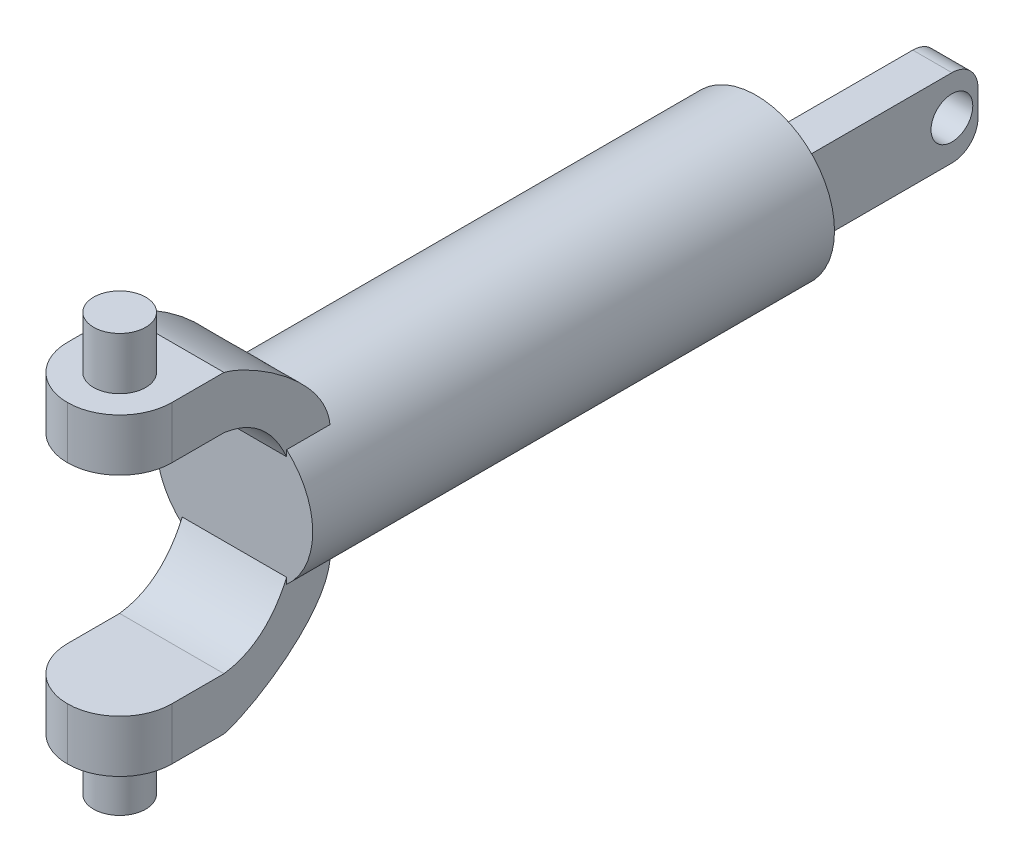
ISO-10303-21;
HEADER;
FILE_DESCRIPTION(('STEP AP214'),'2;1');
FILE_NAME('part.step','',(''),(''),'','','');
FILE_SCHEMA(('AUTOMOTIVE_DESIGN { 1 0 10303 214 1 1 1 1 }'));
ENDSEC;
DATA;
#1=APPLICATION_CONTEXT('core data for automotive mechanical design processes');
#2=APPLICATION_PROTOCOL_DEFINITION('international standard','automotive_design',2000,#1);
#3=PRODUCT_CONTEXT('',#1,'mechanical');
#4=PRODUCT('Part','Part','',(#3));
#5=PRODUCT_RELATED_PRODUCT_CATEGORY('part','',(#4));
#6=PRODUCT_DEFINITION_FORMATION('','',#4);
#7=PRODUCT_DEFINITION_CONTEXT('part definition',#1,'design');
#8=PRODUCT_DEFINITION('design','',#6,#7);
#9=PRODUCT_DEFINITION_SHAPE('','',#8);
#10=(LENGTH_UNIT() NAMED_UNIT(*) SI_UNIT(.MILLI.,.METRE.));
#11=(NAMED_UNIT(*) PLANE_ANGLE_UNIT() SI_UNIT($,.RADIAN.));
#12=(NAMED_UNIT(*) SI_UNIT($,.STERADIAN.) SOLID_ANGLE_UNIT());
#13=UNCERTAINTY_MEASURE_WITH_UNIT(LENGTH_MEASURE(1.E-05),#10,'distance_accuracy_value','');
#14=(GEOMETRIC_REPRESENTATION_CONTEXT(3) GLOBAL_UNCERTAINTY_ASSIGNED_CONTEXT((#13)) GLOBAL_UNIT_ASSIGNED_CONTEXT((#10,
#11,#12)) REPRESENTATION_CONTEXT('',''));
#15=CARTESIAN_POINT('',(0.,0.,0.));
#16=DIRECTION('',(0.,0.,1.));
#17=DIRECTION('',(1.,0.,0.));
#18=AXIS2_PLACEMENT_3D('',#15,#16,#17);
#19=CARTESIAN_POINT('',(0.,0.,-560.));
#20=DIRECTION('',(0.,0.,1.));
#21=DIRECTION('',(1.,0.,0.));
#22=AXIS2_PLACEMENT_3D('',#19,#20,#21);
#23=PLANE('',#22);
#24=CARTESIAN_POINT('',(0.,0.,-560.));
#25=DIRECTION('',(0.,0.,1.));
#26=DIRECTION('',(1.,0.,0.));
#27=AXIS2_PLACEMENT_3D('',#24,#25,#26);
#28=CIRCLE('',#27,75.);
#29=CARTESIAN_POINT('',(75.,0.,-560.));
#30=VERTEX_POINT('',#29);
#31=EDGE_CURVE('E221',#30,#30,#28,.T.);
#32=ORIENTED_EDGE('',*,*,#31,.F.);
#33=EDGE_LOOP('',(#32));
#34=FACE_BOUND('',#33,.T.);
#35=DIRECTION('',(0.,-1.,0.));
#36=VECTOR('',#35,1.);
#37=CARTESIAN_POINT('',(37.5,-37.5,-560.));
#38=LINE('',#37,#36);
#39=CARTESIAN_POINT('',(37.5,37.5,-560.));
#40=VERTEX_POINT('',#39);
#41=CARTESIAN_POINT('',(37.5,-37.5,-560.));
#42=VERTEX_POINT('',#41);
#43=EDGE_CURVE('E188',#40,#42,#38,.T.);
#44=ORIENTED_EDGE('',*,*,#43,.F.);
#45=DIRECTION('',(1.,0.,0.));
#46=VECTOR('',#45,1.);
#47=CARTESIAN_POINT('',(37.5,37.5,-560.));
#48=LINE('',#47,#46);
#49=CARTESIAN_POINT('',(0.,37.5,-560.));
#50=VERTEX_POINT('',#49);
#51=EDGE_CURVE('E199',#50,#40,#48,.T.);
#52=ORIENTED_EDGE('',*,*,#51,.F.);
#53=DIRECTION('',(0.,1.,0.));
#54=VECTOR('',#53,1.);
#55=CARTESIAN_POINT('',(0.,37.5,-560.));
#56=LINE('',#55,#54);
#57=CARTESIAN_POINT('',(0.,-37.5,-560.));
#58=VERTEX_POINT('',#57);
#59=EDGE_CURVE('E208',#58,#50,#56,.T.);
#60=ORIENTED_EDGE('',*,*,#59,.F.);
#61=DIRECTION('',(-1.,0.,0.));
#62=VECTOR('',#61,1.);
#63=CARTESIAN_POINT('',(37.5,-37.5,-560.));
#64=LINE('',#63,#62);
#65=EDGE_CURVE('E202',#42,#58,#64,.T.);
#66=ORIENTED_EDGE('',*,*,#65,.F.);
#67=EDGE_LOOP('',(#44,#52,#60,#66));
#68=FACE_BOUND('',#67,.T.);
#69=ADVANCED_FACE('F38',(#34,#68),#23,.F.);
#70=CARTESIAN_POINT('',(50.,0.,0.));
#71=DIRECTION('',(1.,0.,0.));
#72=DIRECTION('',(0.,0.,-1.));
#73=AXIS2_PLACEMENT_3D('',#70,#71,#72);
#74=PLANE('',#73);
#75=DIRECTION('',(0.,0.,1.));
#76=VECTOR('',#75,1.);
#77=CARTESIAN_POINT('',(50.,55.9016994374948,-560.));
#78=LINE('',#77,#76);
#79=CARTESIAN_POINT('',(50.,55.9016994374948,-101.56051903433));
#80=VERTEX_POINT('',#79);
#81=CARTESIAN_POINT('',(50.,55.9016994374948,-60.));
#82=VERTEX_POINT('',#81);
#83=EDGE_CURVE('E263',#80,#82,#78,.T.);
#84=ORIENTED_EDGE('',*,*,#83,.F.);
#85=CARTESIAN_POINT('',(50.,50.,-101.766630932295));
#86=CARTESIAN_POINT('',(50.,96.3576905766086,-103.379132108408));
#87=CARTESIAN_POINT('',(50.,143.346838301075,-27.0359598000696));
#88=CARTESIAN_POINT('',(50.,150.,0.));
#89=B_SPLINE_CURVE_WITH_KNOTS('',3,(#85,#86,#87,#88),.UNSPECIFIED.,.F.,.F.,(4,4),(0.,1.),.UNSPECIFIED.);
#90=CARTESIAN_POINT('',(50.,150.,0.));
#91=VERTEX_POINT('',#90);
#92=EDGE_CURVE('E277',#80,#91,#89,.T.);
#93=ORIENTED_EDGE('',*,*,#92,.T.);
#94=DIRECTION('',(0.,0.,-1.));
#95=VECTOR('',#94,1.);
#96=CARTESIAN_POINT('',(50.,150.,0.));
#97=LINE('',#96,#95);
#98=CARTESIAN_POINT('',(50.,150.,50.));
#99=VERTEX_POINT('',#98);
#100=EDGE_CURVE('E283',#99,#91,#97,.T.);
#101=ORIENTED_EDGE('',*,*,#100,.F.);
#102=DIRECTION('',(0.,1.,0.));
#103=VECTOR('',#102,1.);
#104=CARTESIAN_POINT('',(50.,0.,50.));
#105=LINE('',#104,#103);
#106=CARTESIAN_POINT('',(50.,100.,50.));
#107=VERTEX_POINT('',#106);
#108=EDGE_CURVE('E371',#99,#107,#105,.F.);
#109=ORIENTED_EDGE('',*,*,#108,.T.);
#110=DIRECTION('',(0.,0.,1.));
#111=VECTOR('',#110,1.);
#112=CARTESIAN_POINT('',(50.,100.,0.));
#113=LINE('',#112,#111);
#114=CARTESIAN_POINT('',(50.,100.,0.));
#115=VERTEX_POINT('',#114);
#116=EDGE_CURVE('E292',#115,#107,#113,.T.);
#117=ORIENTED_EDGE('',*,*,#116,.F.);
#118=CARTESIAN_POINT('',(50.,100.,0.));
#119=CARTESIAN_POINT('',(50.,94.4942840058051,-40.2562345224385));
#120=CARTESIAN_POINT('',(50.,50.,-60.));
#121=B_SPLINE_CURVE_WITH_KNOTS('',2,(#118,#119,#120),.UNSPECIFIED.,.F.,.F.,(3,3),(0.,1.),.UNSPECIFIED.);
#122=CARTESIAN_POINT('',(50.,50.,-60.));
#123=VERTEX_POINT('',#122);
#124=EDGE_CURVE('E295',#115,#123,#121,.T.);
#125=ORIENTED_EDGE('',*,*,#124,.T.);
#126=DIRECTION('',(0.,-1.,0.));
#127=VECTOR('',#126,1.);
#128=CARTESIAN_POINT('',(50.,0.,-60.));
#129=LINE('',#128,#127);
#130=EDGE_CURVE('E229',#82,#123,#129,.T.);
#131=ORIENTED_EDGE('',*,*,#130,.F.);
#132=EDGE_LOOP('',(#84,#93,#101,#109,#117,#125,#131));
#133=FACE_BOUND('',#132,.T.);
#134=ADVANCED_FACE('F324',(#133),#74,.T.);
#135=CARTESIAN_POINT('',(-50.,0.,0.));
#136=DIRECTION('',(1.,0.,0.));
#137=DIRECTION('',(0.,0.,-1.));
#138=AXIS2_PLACEMENT_3D('',#135,#136,#137);
#139=PLANE('',#138);
#140=CARTESIAN_POINT('',(-50.,50.,-101.766630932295));
#141=CARTESIAN_POINT('',(-50.,96.3576905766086,-103.379132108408));
#142=CARTESIAN_POINT('',(-50.,143.346838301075,-27.0359598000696));
#143=CARTESIAN_POINT('',(-50.,150.,0.));
#144=B_SPLINE_CURVE_WITH_KNOTS('',3,(#140,#141,#142,#143),.UNSPECIFIED.,.F.,.F.,(4,4),(0.,1.),.UNSPECIFIED.);
#145=CARTESIAN_POINT('',(-50.,55.9016994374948,-101.56051903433));
#146=VERTEX_POINT('',#145);
#147=CARTESIAN_POINT('',(-50.,150.,0.));
#148=VERTEX_POINT('',#147);
#149=EDGE_CURVE('E347',#146,#148,#144,.T.);
#150=ORIENTED_EDGE('',*,*,#149,.F.);
#151=DIRECTION('',(0.,0.,1.));
#152=VECTOR('',#151,1.);
#153=CARTESIAN_POINT('',(-50.,55.9016994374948,-560.));
#154=LINE('',#153,#152);
#155=CARTESIAN_POINT('',(-50.,55.9016994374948,-60.));
#156=VERTEX_POINT('',#155);
#157=EDGE_CURVE('E338',#146,#156,#154,.T.);
#158=ORIENTED_EDGE('',*,*,#157,.T.);
#159=DIRECTION('',(0.,-1.,0.));
#160=VECTOR('',#159,1.);
#161=CARTESIAN_POINT('',(-50.,0.,-60.));
#162=LINE('',#161,#160);
#163=CARTESIAN_POINT('',(-50.,50.,-60.));
#164=VERTEX_POINT('',#163);
#165=EDGE_CURVE('E394',#156,#164,#162,.T.);
#166=ORIENTED_EDGE('',*,*,#165,.T.);
#167=CARTESIAN_POINT('',(-50.,100.,0.));
#168=CARTESIAN_POINT('',(-50.,94.4942840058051,-40.2562345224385));
#169=CARTESIAN_POINT('',(-50.,50.,-60.));
#170=B_SPLINE_CURVE_WITH_KNOTS('',2,(#167,#168,#169),.UNSPECIFIED.,.F.,.F.,(3,3),(0.,1.),.UNSPECIFIED.);
#171=CARTESIAN_POINT('',(-50.,100.,0.));
#172=VERTEX_POINT('',#171);
#173=EDGE_CURVE('E512',#172,#164,#170,.T.);
#174=ORIENTED_EDGE('',*,*,#173,.F.);
#175=DIRECTION('',(0.,0.,1.));
#176=VECTOR('',#175,1.);
#177=CARTESIAN_POINT('',(-50.,100.,0.));
#178=LINE('',#177,#176);
#179=CARTESIAN_POINT('',(-50.,100.,50.));
#180=VERTEX_POINT('',#179);
#181=EDGE_CURVE('E509',#172,#180,#178,.T.);
#182=ORIENTED_EDGE('',*,*,#181,.T.);
#183=DIRECTION('',(0.,1.,0.));
#184=VECTOR('',#183,1.);
#185=CARTESIAN_POINT('',(-50.,150.,50.));
#186=LINE('',#185,#184);
#187=CARTESIAN_POINT('',(-50.,150.,50.));
#188=VERTEX_POINT('',#187);
#189=EDGE_CURVE('E361',#180,#188,#186,.T.);
#190=ORIENTED_EDGE('',*,*,#189,.T.);
#191=DIRECTION('',(0.,0.,-1.));
#192=VECTOR('',#191,1.);
#193=CARTESIAN_POINT('',(-50.,150.,0.));
#194=LINE('',#193,#192);
#195=EDGE_CURVE('E504',#188,#148,#194,.T.);
#196=ORIENTED_EDGE('',*,*,#195,.T.);
#197=EDGE_LOOP('',(#150,#158,#166,#174,#182,#190,#196));
#198=FACE_BOUND('',#197,.T.);
#199=ADVANCED_FACE('F272',(#198),#139,.F.);
#200=DIRECTION('',(-1.,0.,0.));
#201=VECTOR('',#200,1.);
#202=SURFACE_OF_LINEAR_EXTRUSION('',#89,#201);
#203=ORIENTED_EDGE('',*,*,#92,.F.);
#204=CARTESIAN_POINT('',(50.,55.9016994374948,-101.56051903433));
#205=CARTESIAN_POINT('',(49.3747364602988,56.4609604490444,-101.50287368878));
#206=CARTESIAN_POINT('',(48.7406114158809,57.0092483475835,-101.435819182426));
#207=CARTESIAN_POINT('',(47.4560532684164,58.0828960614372,-101.285729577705));
#208=CARTESIAN_POINT('',(46.8056355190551,58.608276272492,-101.202709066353));
#209=CARTESIAN_POINT('',(45.4890647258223,59.6359130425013,-101.023450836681));
#210=CARTESIAN_POINT('',(44.8229189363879,60.1381799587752,-100.927219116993));
#211=CARTESIAN_POINT('',(43.4754378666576,61.1193978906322,-100.724096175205));
#212=CARTESIAN_POINT('',(42.7941050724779,61.5983526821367,-100.617206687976));
#213=CARTESIAN_POINT('',(41.4168043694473,62.532718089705,-100.39518431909));
#214=CARTESIAN_POINT('',(40.720836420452,62.9881286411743,-100.280051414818));
#215=CARTESIAN_POINT('',(39.3123555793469,63.8767135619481,-100.043401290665));
#216=CARTESIAN_POINT('',(38.59979230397,64.3098023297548,-99.921862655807));
#217=CARTESIAN_POINT('',(37.1610398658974,65.1517607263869,-99.6749364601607));
#218=CARTESIAN_POINT('',(36.4348490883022,65.5606274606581,-99.549548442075));
#219=CARTESIAN_POINT('',(34.9694173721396,66.3538551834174,-99.2969634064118));
#220=CARTESIAN_POINT('',(34.230175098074,66.738213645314,-99.1697662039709));
#221=CARTESIAN_POINT('',(32.7392259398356,67.4821250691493,-98.9154831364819));
#222=CARTESIAN_POINT('',(31.9875181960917,67.841676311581,-98.7883972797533));
#223=CARTESIAN_POINT('',(30.4722520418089,68.535657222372,-98.5361419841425));
#224=CARTESIAN_POINT('',(29.7086931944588,68.8700859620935,-98.4109726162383));
#225=CARTESIAN_POINT('',(27.9788928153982,69.5935751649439,-98.133538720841));
#226=CARTESIAN_POINT('',(27.0095013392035,69.9755187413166,-97.9822834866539));
#227=CARTESIAN_POINT('',(25.0545426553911,70.6990536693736,-97.6884677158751));
#228=CARTESIAN_POINT('',(24.068976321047,71.0406471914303,-97.5459067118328));
#229=CARTESIAN_POINT('',(22.0830541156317,71.6828270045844,-97.2722528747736));
#230=CARTESIAN_POINT('',(21.0826991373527,71.9834157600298,-97.1411593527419));
#231=CARTESIAN_POINT('',(19.068654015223,72.5429446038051,-96.8929278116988));
#232=CARTESIAN_POINT('',(18.0549634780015,72.8018834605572,-96.7757902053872));
#233=CARTESIAN_POINT('',(16.0185496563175,73.2768477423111,-96.5579561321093));
#234=CARTESIAN_POINT('',(14.9958556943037,73.492980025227,-96.4572188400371));
#235=CARTESIAN_POINT('',(12.9407026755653,73.8825562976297,-96.2736981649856));
#236=CARTESIAN_POINT('',(11.9082430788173,74.0559979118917,-96.1909157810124));
#237=CARTESIAN_POINT('',(9.83564286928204,74.3596462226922,-96.0448547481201));
#238=CARTESIAN_POINT('',(8.79550257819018,74.4898547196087,-95.9815752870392));
#239=CARTESIAN_POINT('',(6.70971188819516,74.7066208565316,-95.8756915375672));
#240=CARTESIAN_POINT('',(5.66406179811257,74.7931809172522,-95.8330861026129));
#241=CARTESIAN_POINT('',(3.27830625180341,74.9403118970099,-95.7604983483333));
#242=CARTESIAN_POINT('',(1.93710567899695,74.986980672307,-95.7373118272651));
#243=CARTESIAN_POINT('',(-0.745981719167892,75.0082899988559,-95.7267393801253));
#244=CARTESIAN_POINT('',(-2.08786854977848,74.9829299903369,-95.7393537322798));
#245=CARTESIAN_POINT('',(-4.7675107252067,74.8603340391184,-95.7999914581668));
#246=CARTESIAN_POINT('',(-6.10526619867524,74.7631003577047,-95.8480137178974));
#247=CARTESIAN_POINT('',(-8.77369583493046,74.4971304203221,-95.9780916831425));
#248=CARTESIAN_POINT('',(-10.104358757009,74.328302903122,-96.0601908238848));
#249=CARTESIAN_POINT('',(-12.7524623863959,73.9200216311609,-96.2559305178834));
#250=CARTESIAN_POINT('',(-14.0699028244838,73.6805664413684,-96.3695717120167));
#251=CARTESIAN_POINT('',(-16.6873856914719,73.1322027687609,-96.6249345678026));
#252=CARTESIAN_POINT('',(-17.9874291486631,72.8232984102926,-96.7666545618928));
#253=CARTESIAN_POINT('',(-20.5074583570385,72.1530698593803,-97.0668109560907));
#254=CARTESIAN_POINT('',(-21.7283841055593,71.7947936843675,-97.2241847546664));
#255=CARTESIAN_POINT('',(-24.1482891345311,71.0174286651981,-97.5561179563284));
#256=CARTESIAN_POINT('',(-25.347268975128,70.5983413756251,-97.7306769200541));
#257=CARTESIAN_POINT('',(-27.7209079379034,69.7005132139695,-98.0919530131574));
#258=CARTESIAN_POINT('',(-28.8955649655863,69.2217672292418,-98.278671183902));
#259=CARTESIAN_POINT('',(-31.2168134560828,68.2064029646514,-98.6583863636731));
#260=CARTESIAN_POINT('',(-32.3634372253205,67.669855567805,-98.8513754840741));
#261=CARTESIAN_POINT('',(-34.6279112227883,66.5395302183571,-99.2376171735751));
#262=CARTESIAN_POINT('',(-35.7457642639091,65.9457578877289,-99.4308697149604));
#263=CARTESIAN_POINT('',(-37.9506125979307,64.7020283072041,-99.8107968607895));
#264=CARTESIAN_POINT('',(-39.0376158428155,64.05208571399,-99.9974731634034));
#265=CARTESIAN_POINT('',(-40.6890756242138,63.0069181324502,-100.274573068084));
#266=CARTESIAN_POINT('',(-41.2651122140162,62.6311741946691,-100.369964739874));
#267=CARTESIAN_POINT('',(-42.4071386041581,61.8636226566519,-100.555299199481));
#268=CARTESIAN_POINT('',(-42.9731302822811,61.4718181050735,-100.645243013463));
#269=CARTESIAN_POINT('',(-44.0947128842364,60.6723208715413,-100.818334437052));
#270=CARTESIAN_POINT('',(-44.6503053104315,60.2646305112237,-100.901483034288));
#271=CARTESIAN_POINT('',(-45.7503889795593,59.4338008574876,-101.059518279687));
#272=CARTESIAN_POINT('',(-46.2948879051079,59.0106728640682,-101.134410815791));
#273=CARTESIAN_POINT('',(-47.3728501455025,58.14885448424,-101.274527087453));
#274=CARTESIAN_POINT('',(-47.9063117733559,57.7101617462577,-101.339749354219));
#275=CARTESIAN_POINT('',(-48.9618668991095,56.8173718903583,-101.458964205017));
#276=CARTESIAN_POINT('',(-49.4839553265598,56.3632681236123,-101.512951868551));
#277=CARTESIAN_POINT('',(-50.,55.9016994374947,-101.56051903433));
#278=B_SPLINE_CURVE_WITH_KNOTS('',3,(#204,#205,#206,#207,#208,#209,#210,#211,#212,#213,#214,
#215,#216,#217,#218,#219,#220,#221,#222,#223,#224,#225,#226,#227,#228,#229,#230,#231,#232,#233,
#234,#235,#236,#237,#238,#239,#240,#241,#242,#243,#244,#245,#246,#247,#248,#249,#250,#251,#252,
#253,#254,#255,#256,#257,#258,#259,#260,#261,#262,#263,#264,#265,#266,#267,#268,#269,#270,#271,
#272,#273,#274,#275,#276,#277),.UNSPECIFIED.,.F.,.F.,(4,2,2,2,2,2,2,2,2,2,2,2,2,2,2,2,2,2,2,2,2,
2,2,2,2,2,2,2,2,2,2,2,2,2,2,2,4),(0.,2.52232583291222,5.04235804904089,7.56124979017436,
10.0797321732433,12.5982214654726,15.1257426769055,17.6535653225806,20.1816481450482,
22.7099060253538,25.2382573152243,28.3958351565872,31.5532430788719,34.7104611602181,
37.8677725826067,41.0171002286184,44.1666030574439,47.3159747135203,50.4651716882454,
54.4893122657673,58.5134841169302,62.5375293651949,66.5667195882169,70.5959916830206,
74.6250245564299,78.4695667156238,82.3140106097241,86.1587841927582,89.9988953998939,
93.8386297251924,97.6773651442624,99.7601353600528,101.842512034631,103.924585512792,
106.005164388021,108.08605895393,110.167862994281),.UNSPECIFIED.);
#279=EDGE_CURVE('E255',#80,#146,#278,.T.);
#280=ORIENTED_EDGE('',*,*,#279,.T.);
#281=ORIENTED_EDGE('',*,*,#149,.T.);
#282=DIRECTION('',(-1.,0.,0.));
#283=VECTOR('',#282,1.);
#284=CARTESIAN_POINT('',(50.,150.,0.));
#285=LINE('',#284,#283);
#286=EDGE_CURVE('E346',#91,#148,#285,.T.);
#287=ORIENTED_EDGE('',*,*,#286,.F.);
#288=EDGE_LOOP('',(#203,#280,#281,#287));
#289=FACE_BOUND('',#288,.T.);
#290=ADVANCED_FACE('F265',(#289),#202,.F.);
#291=CARTESIAN_POINT('',(50.,150.,0.));
#292=DIRECTION('',(0.,1.,0.));
#293=DIRECTION('',(0.,0.,1.));
#294=AXIS2_PLACEMENT_3D('',#291,#292,#293);
#295=PLANE('',#294);
#296=CARTESIAN_POINT('',(0.,150.,50.));
#297=DIRECTION('',(0.,1.,0.));
#298=DIRECTION('',(0.,0.,1.));
#299=AXIS2_PLACEMENT_3D('',#296,#297,#298);
#300=CIRCLE('',#299,25.);
#301=CARTESIAN_POINT('',(0.,150.,75.));
#302=VERTEX_POINT('',#301);
#303=EDGE_CURVE('E343',#302,#302,#300,.T.);
#304=ORIENTED_EDGE('',*,*,#303,.F.);
#305=EDGE_LOOP('',(#304));
#306=FACE_BOUND('',#305,.T.);
#307=ORIENTED_EDGE('',*,*,#195,.F.);
#308=CARTESIAN_POINT('',(0.,150.,50.));
#309=DIRECTION('',(0.,1.,0.));
#310=DIRECTION('',(0.,0.,1.));
#311=AXIS2_PLACEMENT_3D('',#308,#309,#310);
#312=CIRCLE('',#311,50.);
#313=CARTESIAN_POINT('',(0.,150.,100.));
#314=VERTEX_POINT('',#313);
#315=EDGE_CURVE('E377',#188,#314,#312,.T.);
#316=ORIENTED_EDGE('',*,*,#315,.T.);
#317=CARTESIAN_POINT('',(0.,150.,50.));
#318=DIRECTION('',(0.,1.,0.));
#319=DIRECTION('',(0.,0.,1.));
#320=AXIS2_PLACEMENT_3D('',#317,#318,#319);
#321=CIRCLE('',#320,50.);
#322=EDGE_CURVE('E375',#314,#99,#321,.T.);
#323=ORIENTED_EDGE('',*,*,#322,.T.);
#324=ORIENTED_EDGE('',*,*,#100,.T.);
#325=ORIENTED_EDGE('',*,*,#286,.T.);
#326=EDGE_LOOP('',(#307,#316,#323,#324,#325));
#327=FACE_BOUND('',#326,.T.);
#328=ADVANCED_FACE('F271',(#306,#327),#295,.T.);
#329=CARTESIAN_POINT('',(50.,100.,0.));
#330=DIRECTION('',(0.,-1.,0.));
#331=DIRECTION('',(0.,0.,-1.));
#332=AXIS2_PLACEMENT_3D('',#329,#330,#331);
#333=PLANE('',#332);
#334=CARTESIAN_POINT('',(0.,100.,50.));
#335=DIRECTION('',(0.,-1.,0.));
#336=DIRECTION('',(0.,0.,-1.));
#337=AXIS2_PLACEMENT_3D('',#334,#335,#336);
#338=CIRCLE('',#337,50.);
#339=CARTESIAN_POINT('',(0.,100.,100.));
#340=VERTEX_POINT('',#339);
#341=EDGE_CURVE('E379',#107,#340,#338,.T.);
#342=ORIENTED_EDGE('',*,*,#341,.T.);
#343=CARTESIAN_POINT('',(0.,100.,50.));
#344=DIRECTION('',(0.,-1.,0.));
#345=DIRECTION('',(0.,0.,-1.));
#346=AXIS2_PLACEMENT_3D('',#343,#344,#345);
#347=CIRCLE('',#346,50.);
#348=EDGE_CURVE('E381',#340,#180,#347,.T.);
#349=ORIENTED_EDGE('',*,*,#348,.T.);
#350=ORIENTED_EDGE('',*,*,#181,.F.);
#351=DIRECTION('',(-1.,0.,0.));
#352=VECTOR('',#351,1.);
#353=CARTESIAN_POINT('',(50.,100.,0.));
#354=LINE('',#353,#352);
#355=EDGE_CURVE('E352',#115,#172,#354,.T.);
#356=ORIENTED_EDGE('',*,*,#355,.F.);
#357=ORIENTED_EDGE('',*,*,#116,.T.);
#358=EDGE_LOOP('',(#342,#349,#350,#356,#357));
#359=FACE_BOUND('',#358,.T.);
#360=ADVANCED_FACE('F314',(#359),#333,.T.);
#361=DIRECTION('',(-1.,0.,0.));
#362=VECTOR('',#361,1.);
#363=SURFACE_OF_LINEAR_EXTRUSION('',#121,#362);
#364=ORIENTED_EDGE('',*,*,#173,.T.);
#365=DIRECTION('',(-1.,0.,0.));
#366=VECTOR('',#365,1.);
#367=CARTESIAN_POINT('',(50.,50.,-60.));
#368=LINE('',#367,#366);
#369=EDGE_CURVE('E356',#123,#164,#368,.T.);
#370=ORIENTED_EDGE('',*,*,#369,.F.);
#371=ORIENTED_EDGE('',*,*,#124,.F.);
#372=ORIENTED_EDGE('',*,*,#355,.T.);
#373=EDGE_LOOP('',(#364,#370,#371,#372));
#374=FACE_BOUND('',#373,.T.);
#375=ADVANCED_FACE('F310',(#374),#363,.F.);
#376=CARTESIAN_POINT('',(50.,0.,-60.));
#377=DIRECTION('',(0.,0.,1.));
#378=DIRECTION('',(1.,0.,0.));
#379=AXIS2_PLACEMENT_3D('',#376,#377,#378);
#380=PLANE('',#379);
#381=ORIENTED_EDGE('',*,*,#369,.T.);
#382=ORIENTED_EDGE('',*,*,#165,.F.);
#383=CARTESIAN_POINT('',(0.,0.,-60.));
#384=DIRECTION('',(0.,0.,1.));
#385=DIRECTION('',(1.,0.,0.));
#386=AXIS2_PLACEMENT_3D('',#383,#384,#385);
#387=CIRCLE('',#386,75.);
#388=CARTESIAN_POINT('',(-50.,-55.9016994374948,-60.));
#389=VERTEX_POINT('',#388);
#390=EDGE_CURVE('E225',#156,#389,#387,.T.);
#391=ORIENTED_EDGE('',*,*,#390,.T.);
#392=CARTESIAN_POINT('',(-50.,-50.,-60.));
#393=VERTEX_POINT('',#392);
#394=EDGE_CURVE('E390',#393,#389,#162,.T.);
#395=ORIENTED_EDGE('',*,*,#394,.F.);
#396=DIRECTION('',(-1.,0.,0.));
#397=VECTOR('',#396,1.);
#398=CARTESIAN_POINT('',(50.,-50.,-60.));
#399=LINE('',#398,#397);
#400=CARTESIAN_POINT('',(50.,-50.,-60.));
#401=VERTEX_POINT('',#400);
#402=EDGE_CURVE('E542',#401,#393,#399,.T.);
#403=ORIENTED_EDGE('',*,*,#402,.F.);
#404=CARTESIAN_POINT('',(50.,-55.9016994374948,-60.));
#405=VERTEX_POINT('',#404);
#406=EDGE_CURVE('E224',#401,#405,#129,.T.);
#407=ORIENTED_EDGE('',*,*,#406,.T.);
#408=EDGE_CURVE('E220',#405,#82,#387,.T.);
#409=ORIENTED_EDGE('',*,*,#408,.T.);
#410=ORIENTED_EDGE('',*,*,#130,.T.);
#411=EDGE_LOOP('',(#381,#382,#391,#395,#403,#407,#409,#410));
#412=FACE_BOUND('',#411,.T.);
#413=ADVANCED_FACE('F313',(#412),#380,.T.);
#414=CARTESIAN_POINT('',(50.,-100.,0.));
#415=CARTESIAN_POINT('',(50.,-94.4942840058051,-40.2562345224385));
#416=CARTESIAN_POINT('',(50.,-50.,-60.));
#417=B_SPLINE_CURVE_WITH_KNOTS('',2,(#414,#415,#416),.UNSPECIFIED.,.F.,.F.,(3,3),(0.,1.),.UNSPECIFIED.);
#418=DIRECTION('',(-1.,0.,0.));
#419=VECTOR('',#418,1.);
#420=SURFACE_OF_LINEAR_EXTRUSION('',#417,#419);
#421=CARTESIAN_POINT('',(-50.,-100.,0.));
#422=CARTESIAN_POINT('',(-50.,-94.4942840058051,-40.2562345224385));
#423=CARTESIAN_POINT('',(-50.,-50.,-60.));
#424=B_SPLINE_CURVE_WITH_KNOTS('',2,(#421,#422,#423),.UNSPECIFIED.,.F.,.F.,(3,3),(0.,1.),.UNSPECIFIED.);
#425=CARTESIAN_POINT('',(-50.,-100.,0.));
#426=VERTEX_POINT('',#425);
#427=EDGE_CURVE('E517',#426,#393,#424,.T.);
#428=ORIENTED_EDGE('',*,*,#427,.F.);
#429=DIRECTION('',(-1.,0.,0.));
#430=VECTOR('',#429,1.);
#431=CARTESIAN_POINT('',(50.,-100.,0.));
#432=LINE('',#431,#430);
#433=CARTESIAN_POINT('',(50.,-100.,0.));
#434=VERTEX_POINT('',#433);
#435=EDGE_CURVE('E540',#434,#426,#432,.T.);
#436=ORIENTED_EDGE('',*,*,#435,.F.);
#437=EDGE_CURVE('E301',#434,#401,#417,.T.);
#438=ORIENTED_EDGE('',*,*,#437,.T.);
#439=ORIENTED_EDGE('',*,*,#402,.T.);
#440=EDGE_LOOP('',(#428,#436,#438,#439));
#441=FACE_BOUND('',#440,.T.);
#442=ADVANCED_FACE('F596',(#441),#420,.T.);
#443=CARTESIAN_POINT('',(50.,-100.,0.));
#444=DIRECTION('',(0.,-1.,0.));
#445=DIRECTION('',(0.,0.,-1.));
#446=AXIS2_PLACEMENT_3D('',#443,#444,#445);
#447=PLANE('',#446);
#448=DIRECTION('',(0.,0.,1.));
#449=VECTOR('',#448,1.);
#450=CARTESIAN_POINT('',(-50.,-100.,0.));
#451=LINE('',#450,#449);
#452=CARTESIAN_POINT('',(-50.,-100.,50.));
#453=VERTEX_POINT('',#452);
#454=EDGE_CURVE('E525',#426,#453,#451,.T.);
#455=ORIENTED_EDGE('',*,*,#454,.T.);
#456=CARTESIAN_POINT('',(0.,-100.,50.));
#457=DIRECTION('',(0.,-1.,0.));
#458=DIRECTION('',(0.,0.,-1.));
#459=AXIS2_PLACEMENT_3D('',#456,#457,#458);
#460=CIRCLE('',#459,50.);
#461=CARTESIAN_POINT('',(0.,-100.,100.));
#462=VERTEX_POINT('',#461);
#463=EDGE_CURVE('E369',#453,#462,#460,.F.);
#464=ORIENTED_EDGE('',*,*,#463,.T.);
#465=CARTESIAN_POINT('',(0.,-100.,50.));
#466=DIRECTION('',(0.,-1.,0.));
#467=DIRECTION('',(0.,0.,-1.));
#468=AXIS2_PLACEMENT_3D('',#465,#466,#467);
#469=CIRCLE('',#468,50.);
#470=CARTESIAN_POINT('',(50.,-100.,50.));
#471=VERTEX_POINT('',#470);
#472=EDGE_CURVE('E367',#462,#471,#469,.F.);
#473=ORIENTED_EDGE('',*,*,#472,.T.);
#474=DIRECTION('',(0.,0.,1.));
#475=VECTOR('',#474,1.);
#476=CARTESIAN_POINT('',(50.,-100.,0.));
#477=LINE('',#476,#475);
#478=EDGE_CURVE('E486',#434,#471,#477,.T.);
#479=ORIENTED_EDGE('',*,*,#478,.F.);
#480=ORIENTED_EDGE('',*,*,#435,.T.);
#481=EDGE_LOOP('',(#455,#464,#473,#479,#480));
#482=FACE_BOUND('',#481,.T.);
#483=ADVANCED_FACE('F590',(#482),#447,.F.);
#484=CARTESIAN_POINT('',(50.,-150.,0.));
#485=DIRECTION('',(0.,1.,0.));
#486=DIRECTION('',(0.,0.,1.));
#487=AXIS2_PLACEMENT_3D('',#484,#485,#486);
#488=PLANE('',#487);
#489=CARTESIAN_POINT('',(0.,-150.,50.));
#490=DIRECTION('',(0.,-1.,0.));
#491=DIRECTION('',(0.,0.,-1.));
#492=AXIS2_PLACEMENT_3D('',#489,#490,#491);
#493=CIRCLE('',#492,25.);
#494=CARTESIAN_POINT('',(0.,-150.,25.));
#495=VERTEX_POINT('',#494);
#496=EDGE_CURVE('E285',#495,#495,#493,.T.);
#497=ORIENTED_EDGE('',*,*,#496,.F.);
#498=EDGE_LOOP('',(#497));
#499=FACE_BOUND('',#498,.T.);
#500=CARTESIAN_POINT('',(0.,-150.,50.));
#501=DIRECTION('',(0.,1.,0.));
#502=DIRECTION('',(0.,0.,1.));
#503=AXIS2_PLACEMENT_3D('',#500,#501,#502);
#504=CIRCLE('',#503,50.);
#505=CARTESIAN_POINT('',(50.,-150.,50.));
#506=VERTEX_POINT('',#505);
#507=CARTESIAN_POINT('',(0.,-150.,100.));
#508=VERTEX_POINT('',#507);
#509=EDGE_CURVE('E351',#506,#508,#504,.F.);
#510=ORIENTED_EDGE('',*,*,#509,.T.);
#511=CARTESIAN_POINT('',(0.,-150.,50.));
#512=DIRECTION('',(0.,1.,0.));
#513=DIRECTION('',(0.,0.,1.));
#514=AXIS2_PLACEMENT_3D('',#511,#512,#513);
#515=CIRCLE('',#514,50.);
#516=CARTESIAN_POINT('',(-50.,-150.,50.));
#517=VERTEX_POINT('',#516);
#518=EDGE_CURVE('E354',#508,#517,#515,.F.);
#519=ORIENTED_EDGE('',*,*,#518,.T.);
#520=DIRECTION('',(0.,0.,-1.));
#521=VECTOR('',#520,1.);
#522=CARTESIAN_POINT('',(-50.,-150.,0.));
#523=LINE('',#522,#521);
#524=CARTESIAN_POINT('',(-50.,-150.,0.));
#525=VERTEX_POINT('',#524);
#526=EDGE_CURVE('E531',#517,#525,#523,.T.);
#527=ORIENTED_EDGE('',*,*,#526,.T.);
#528=DIRECTION('',(-1.,0.,0.));
#529=VECTOR('',#528,1.);
#530=CARTESIAN_POINT('',(50.,-150.,0.));
#531=LINE('',#530,#529);
#532=CARTESIAN_POINT('',(50.,-150.,0.));
#533=VERTEX_POINT('',#532);
#534=EDGE_CURVE('E491',#533,#525,#531,.T.);
#535=ORIENTED_EDGE('',*,*,#534,.F.);
#536=DIRECTION('',(0.,0.,-1.));
#537=VECTOR('',#536,1.);
#538=CARTESIAN_POINT('',(50.,-150.,0.));
#539=LINE('',#538,#537);
#540=EDGE_CURVE('E482',#506,#533,#539,.T.);
#541=ORIENTED_EDGE('',*,*,#540,.F.);
#542=EDGE_LOOP('',(#510,#519,#527,#535,#541));
#543=FACE_BOUND('',#542,.T.);
#544=ADVANCED_FACE('F488',(#499,#543),#488,.F.);
#545=CARTESIAN_POINT('',(50.,-50.,-101.766630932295));
#546=CARTESIAN_POINT('',(50.,-96.3576905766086,-103.379132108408));
#547=CARTESIAN_POINT('',(50.,-143.346838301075,-27.0359598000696));
#548=CARTESIAN_POINT('',(50.,-150.,0.));
#549=B_SPLINE_CURVE_WITH_KNOTS('',3,(#545,#546,#547,#548),.UNSPECIFIED.,.F.,.F.,(4,4),(0.,1.),.UNSPECIFIED.);
#550=DIRECTION('',(-1.,0.,0.));
#551=VECTOR('',#550,1.);
#552=SURFACE_OF_LINEAR_EXTRUSION('',#549,#551);
#553=CARTESIAN_POINT('',(50.,-55.9016994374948,-101.56051903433));
#554=CARTESIAN_POINT('',(49.3747364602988,-56.4609604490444,-101.50287368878));
#555=CARTESIAN_POINT('',(48.7406114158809,-57.0092483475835,-101.435819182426));
#556=CARTESIAN_POINT('',(47.4560532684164,-58.0828960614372,-101.285729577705));
#557=CARTESIAN_POINT('',(46.8056355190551,-58.608276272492,-101.202709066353));
#558=CARTESIAN_POINT('',(45.4890647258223,-59.6359130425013,-101.023450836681));
#559=CARTESIAN_POINT('',(44.8229189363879,-60.1381799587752,-100.927219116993));
#560=CARTESIAN_POINT('',(43.4754378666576,-61.1193978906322,-100.724096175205));
#561=CARTESIAN_POINT('',(42.7941050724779,-61.5983526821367,-100.617206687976));
#562=CARTESIAN_POINT('',(41.4168043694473,-62.532718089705,-100.39518431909));
#563=CARTESIAN_POINT('',(40.720836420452,-62.9881286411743,-100.280051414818));
#564=CARTESIAN_POINT('',(39.3123555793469,-63.8767135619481,-100.043401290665));
#565=CARTESIAN_POINT('',(38.59979230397,-64.3098023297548,-99.921862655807));
#566=CARTESIAN_POINT('',(37.1610398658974,-65.1517607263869,-99.6749364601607));
#567=CARTESIAN_POINT('',(36.4348490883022,-65.5606274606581,-99.549548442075));
#568=CARTESIAN_POINT('',(34.9694173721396,-66.3538551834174,-99.2969634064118));
#569=CARTESIAN_POINT('',(34.230175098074,-66.738213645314,-99.1697662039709));
#570=CARTESIAN_POINT('',(32.7392259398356,-67.4821250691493,-98.9154831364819));
#571=CARTESIAN_POINT('',(31.9875181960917,-67.841676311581,-98.7883972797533));
#572=CARTESIAN_POINT('',(30.4722520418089,-68.535657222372,-98.5361419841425));
#573=CARTESIAN_POINT('',(29.7086931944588,-68.8700859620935,-98.4109726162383));
#574=CARTESIAN_POINT('',(27.9788928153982,-69.5935751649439,-98.133538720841));
#575=CARTESIAN_POINT('',(27.0095013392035,-69.9755187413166,-97.9822834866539));
#576=CARTESIAN_POINT('',(25.0545426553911,-70.6990536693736,-97.6884677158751));
#577=CARTESIAN_POINT('',(24.068976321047,-71.0406471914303,-97.5459067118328));
#578=CARTESIAN_POINT('',(22.0830541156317,-71.6828270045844,-97.2722528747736));
#579=CARTESIAN_POINT('',(21.0826991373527,-71.9834157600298,-97.1411593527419));
#580=CARTESIAN_POINT('',(19.068654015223,-72.5429446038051,-96.8929278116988));
#581=CARTESIAN_POINT('',(18.0549634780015,-72.8018834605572,-96.7757902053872));
#582=CARTESIAN_POINT('',(16.0185496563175,-73.2768477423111,-96.5579561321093));
#583=CARTESIAN_POINT('',(14.9958556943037,-73.492980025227,-96.4572188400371));
#584=CARTESIAN_POINT('',(12.9407026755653,-73.8825562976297,-96.2736981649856));
#585=CARTESIAN_POINT('',(11.9082430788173,-74.0559979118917,-96.1909157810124));
#586=CARTESIAN_POINT('',(9.83564286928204,-74.3596462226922,-96.0448547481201));
#587=CARTESIAN_POINT('',(8.79550257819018,-74.4898547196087,-95.9815752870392));
#588=CARTESIAN_POINT('',(6.70971188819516,-74.7066208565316,-95.8756915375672));
#589=CARTESIAN_POINT('',(5.66406179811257,-74.7931809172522,-95.8330861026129));
#590=CARTESIAN_POINT('',(3.27830625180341,-74.9403118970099,-95.7604983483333));
#591=CARTESIAN_POINT('',(1.93710567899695,-74.986980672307,-95.7373118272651));
#592=CARTESIAN_POINT('',(-0.745981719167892,-75.0082899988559,-95.7267393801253));
#593=CARTESIAN_POINT('',(-2.08786854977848,-74.9829299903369,-95.7393537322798));
#594=CARTESIAN_POINT('',(-4.7675107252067,-74.8603340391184,-95.7999914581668));
#595=CARTESIAN_POINT('',(-6.10526619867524,-74.7631003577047,-95.8480137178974));
#596=CARTESIAN_POINT('',(-8.77369583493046,-74.4971304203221,-95.9780916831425));
#597=CARTESIAN_POINT('',(-10.104358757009,-74.328302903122,-96.0601908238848));
#598=CARTESIAN_POINT('',(-12.7524623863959,-73.9200216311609,-96.2559305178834));
#599=CARTESIAN_POINT('',(-14.0699028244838,-73.6805664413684,-96.3695717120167));
#600=CARTESIAN_POINT('',(-16.6873856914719,-73.1322027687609,-96.6249345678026));
#601=CARTESIAN_POINT('',(-17.9874291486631,-72.8232984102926,-96.7666545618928));
#602=CARTESIAN_POINT('',(-20.5074583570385,-72.1530698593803,-97.0668109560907));
#603=CARTESIAN_POINT('',(-21.7283841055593,-71.7947936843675,-97.2241847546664));
#604=CARTESIAN_POINT('',(-24.1482891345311,-71.0174286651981,-97.5561179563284));
#605=CARTESIAN_POINT('',(-25.347268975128,-70.5983413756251,-97.7306769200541));
#606=CARTESIAN_POINT('',(-27.7209079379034,-69.7005132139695,-98.0919530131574));
#607=CARTESIAN_POINT('',(-28.8955649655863,-69.2217672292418,-98.278671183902));
#608=CARTESIAN_POINT('',(-31.2168134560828,-68.2064029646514,-98.6583863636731));
#609=CARTESIAN_POINT('',(-32.3634372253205,-67.669855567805,-98.8513754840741));
#610=CARTESIAN_POINT('',(-34.6279112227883,-66.5395302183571,-99.2376171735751));
#611=CARTESIAN_POINT('',(-35.7457642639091,-65.9457578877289,-99.4308697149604));
#612=CARTESIAN_POINT('',(-37.9506125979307,-64.7020283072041,-99.8107968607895));
#613=CARTESIAN_POINT('',(-39.0376158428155,-64.05208571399,-99.9974731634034));
#614=CARTESIAN_POINT('',(-40.6890756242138,-63.0069181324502,-100.274573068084));
#615=CARTESIAN_POINT('',(-41.2651122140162,-62.6311741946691,-100.369964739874));
#616=CARTESIAN_POINT('',(-42.4071386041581,-61.8636226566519,-100.555299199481));
#617=CARTESIAN_POINT('',(-42.9731302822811,-61.4718181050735,-100.645243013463));
#618=CARTESIAN_POINT('',(-44.0947128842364,-60.6723208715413,-100.818334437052));
#619=CARTESIAN_POINT('',(-44.6503053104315,-60.2646305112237,-100.901483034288));
#620=CARTESIAN_POINT('',(-45.7503889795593,-59.4338008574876,-101.059518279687));
#621=CARTESIAN_POINT('',(-46.2948879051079,-59.0106728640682,-101.134410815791));
#622=CARTESIAN_POINT('',(-47.3728501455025,-58.14885448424,-101.274527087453));
#623=CARTESIAN_POINT('',(-47.9063117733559,-57.7101617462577,-101.339749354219));
#624=CARTESIAN_POINT('',(-48.9618668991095,-56.8173718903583,-101.458964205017));
#625=CARTESIAN_POINT('',(-49.4839553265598,-56.3632681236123,-101.512951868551));
#626=CARTESIAN_POINT('',(-50.,-55.9016994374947,-101.56051903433));
#627=B_SPLINE_CURVE_WITH_KNOTS('',3,(#553,#554,#555,#556,#557,#558,#559,#560,#561,#562,#563,
#564,#565,#566,#567,#568,#569,#570,#571,#572,#573,#574,#575,#576,#577,#578,#579,#580,#581,#582,
#583,#584,#585,#586,#587,#588,#589,#590,#591,#592,#593,#594,#595,#596,#597,#598,#599,#600,#601,
#602,#603,#604,#605,#606,#607,#608,#609,#610,#611,#612,#613,#614,#615,#616,#617,#618,#619,#620,
#621,#622,#623,#624,#625,#626),.UNSPECIFIED.,.F.,.F.,(4,2,2,2,2,2,2,2,2,2,2,2,2,2,2,2,2,2,2,2,2,
2,2,2,2,2,2,2,2,2,2,2,2,2,2,2,4),(0.,2.52232583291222,5.04235804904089,7.56124979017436,
10.0797321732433,12.5982214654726,15.1257426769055,17.6535653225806,20.1816481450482,
22.7099060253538,25.2382573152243,28.3958351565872,31.5532430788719,34.7104611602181,
37.8677725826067,41.0171002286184,44.1666030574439,47.3159747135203,50.4651716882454,
54.4893122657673,58.5134841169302,62.5375293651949,66.5667195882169,70.5959916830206,
74.6250245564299,78.4695667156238,82.3140106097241,86.1587841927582,89.9988953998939,
93.8386297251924,97.6773651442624,99.7601353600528,101.842512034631,103.924585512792,
106.005164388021,108.08605895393,110.167862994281),.UNSPECIFIED.);
#628=CARTESIAN_POINT('',(50.,-55.9016994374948,-101.56051903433));
#629=VERTEX_POINT('',#628);
#630=CARTESIAN_POINT('',(-50.,-55.9016994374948,-101.56051903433));
#631=VERTEX_POINT('',#630);
#632=EDGE_CURVE('E230',#629,#631,#627,.T.);
#633=ORIENTED_EDGE('',*,*,#632,.F.);
#634=EDGE_CURVE('E492',#629,#533,#549,.T.);
#635=ORIENTED_EDGE('',*,*,#634,.T.);
#636=ORIENTED_EDGE('',*,*,#534,.T.);
#637=CARTESIAN_POINT('',(-50.,-50.,-101.766630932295));
#638=CARTESIAN_POINT('',(-50.,-96.3576905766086,-103.379132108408));
#639=CARTESIAN_POINT('',(-50.,-143.346838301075,-27.0359598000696));
#640=CARTESIAN_POINT('',(-50.,-150.,0.));
#641=B_SPLINE_CURVE_WITH_KNOTS('',3,(#637,#638,#639,#640),.UNSPECIFIED.,.F.,.F.,(4,4),(0.,1.),.UNSPECIFIED.);
#642=EDGE_CURVE('E284',#631,#525,#641,.T.);
#643=ORIENTED_EDGE('',*,*,#642,.F.);
#644=EDGE_LOOP('',(#633,#635,#636,#643));
#645=FACE_BOUND('',#644,.T.);
#646=ADVANCED_FACE('F240',(#645),#552,.T.);
#647=DIRECTION('',(0.,0.,1.));
#648=VECTOR('',#647,1.);
#649=CARTESIAN_POINT('',(50.,-55.9016994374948,-560.));
#650=LINE('',#649,#648);
#651=EDGE_CURVE('E238',#405,#629,#650,.F.);
#652=ORIENTED_EDGE('',*,*,#651,.F.);
#653=ORIENTED_EDGE('',*,*,#406,.F.);
#654=ORIENTED_EDGE('',*,*,#437,.F.);
#655=ORIENTED_EDGE('',*,*,#478,.T.);
#656=DIRECTION('',(0.,-1.,0.));
#657=VECTOR('',#656,1.);
#658=CARTESIAN_POINT('',(50.,-150.,50.));
#659=LINE('',#658,#657);
#660=EDGE_CURVE('E373',#471,#506,#659,.T.);
#661=ORIENTED_EDGE('',*,*,#660,.T.);
#662=ORIENTED_EDGE('',*,*,#540,.T.);
#663=ORIENTED_EDGE('',*,*,#634,.F.);
#664=EDGE_LOOP('',(#652,#653,#654,#655,#661,#662,#663));
#665=FACE_BOUND('',#664,.T.);
#666=ADVANCED_FACE('F331',(#665),#74,.T.);
#667=ORIENTED_EDGE('',*,*,#394,.T.);
#668=DIRECTION('',(0.,0.,1.));
#669=VECTOR('',#668,1.);
#670=CARTESIAN_POINT('',(-50.,-55.9016994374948,-560.));
#671=LINE('',#670,#669);
#672=EDGE_CURVE('E393',#389,#631,#671,.F.);
#673=ORIENTED_EDGE('',*,*,#672,.T.);
#674=ORIENTED_EDGE('',*,*,#642,.T.);
#675=ORIENTED_EDGE('',*,*,#526,.F.);
#676=DIRECTION('',(0.,-1.,0.));
#677=VECTOR('',#676,1.);
#678=CARTESIAN_POINT('',(-50.,0.,50.));
#679=LINE('',#678,#677);
#680=EDGE_CURVE('E364',#517,#453,#679,.F.);
#681=ORIENTED_EDGE('',*,*,#680,.T.);
#682=ORIENTED_EDGE('',*,*,#454,.F.);
#683=ORIENTED_EDGE('',*,*,#427,.T.);
#684=EDGE_LOOP('',(#667,#673,#674,#675,#681,#682,#683));
#685=FACE_BOUND('',#684,.T.);
#686=ADVANCED_FACE('F464',(#685),#139,.F.);
#687=CARTESIAN_POINT('',(0.,0.,50.));
#688=DIRECTION('',(0.,1.,0.));
#689=DIRECTION('',(0.,0.,1.));
#690=AXIS2_PLACEMENT_3D('',#687,#688,#689);
#691=CYLINDRICAL_SURFACE('',#690,50.);
#692=ORIENTED_EDGE('',*,*,#660,.F.);
#693=ORIENTED_EDGE('',*,*,#472,.F.);
#694=DIRECTION('',(0.,-1.,0.));
#695=VECTOR('',#694,1.);
#696=CARTESIAN_POINT('',(0.,-100.,100.));
#697=LINE('',#696,#695);
#698=EDGE_CURVE('E383',#508,#462,#697,.F.);
#699=ORIENTED_EDGE('',*,*,#698,.F.);
#700=ORIENTED_EDGE('',*,*,#509,.F.);
#701=EDGE_LOOP('',(#692,#693,#699,#700));
#702=FACE_BOUND('',#701,.T.);
#703=ADVANCED_FACE('F462',(#702),#691,.T.);
#704=CARTESIAN_POINT('',(0.,0.,50.));
#705=DIRECTION('',(0.,-1.,0.));
#706=DIRECTION('',(0.,0.,-1.));
#707=AXIS2_PLACEMENT_3D('',#704,#705,#706);
#708=CYLINDRICAL_SURFACE('',#707,50.);
#709=ORIENTED_EDGE('',*,*,#463,.F.);
#710=ORIENTED_EDGE('',*,*,#680,.F.);
#711=ORIENTED_EDGE('',*,*,#518,.F.);
#712=ORIENTED_EDGE('',*,*,#698,.T.);
#713=EDGE_LOOP('',(#709,#710,#711,#712));
#714=FACE_BOUND('',#713,.T.);
#715=ADVANCED_FACE('F275',(#714),#708,.T.);
#716=CARTESIAN_POINT('',(0.,0.,50.));
#717=DIRECTION('',(0.,1.,0.));
#718=DIRECTION('',(0.,0.,1.));
#719=AXIS2_PLACEMENT_3D('',#716,#717,#718);
#720=CYLINDRICAL_SURFACE('',#719,50.);
#721=DIRECTION('',(0.,1.,0.));
#722=VECTOR('',#721,1.);
#723=CARTESIAN_POINT('',(0.,0.,100.));
#724=LINE('',#723,#722);
#725=EDGE_CURVE('E386',#340,#314,#724,.T.);
#726=ORIENTED_EDGE('',*,*,#725,.F.);
#727=ORIENTED_EDGE('',*,*,#341,.F.);
#728=ORIENTED_EDGE('',*,*,#108,.F.);
#729=ORIENTED_EDGE('',*,*,#322,.F.);
#730=EDGE_LOOP('',(#726,#727,#728,#729));
#731=FACE_BOUND('',#730,.T.);
#732=ADVANCED_FACE('F454',(#731),#720,.T.);
#733=CARTESIAN_POINT('',(0.,0.,50.));
#734=DIRECTION('',(0.,-1.,0.));
#735=DIRECTION('',(0.,0.,-1.));
#736=AXIS2_PLACEMENT_3D('',#733,#734,#735);
#737=CYLINDRICAL_SURFACE('',#736,50.);
#738=ORIENTED_EDGE('',*,*,#348,.F.);
#739=ORIENTED_EDGE('',*,*,#725,.T.);
#740=ORIENTED_EDGE('',*,*,#315,.F.);
#741=ORIENTED_EDGE('',*,*,#189,.F.);
#742=EDGE_LOOP('',(#738,#739,#740,#741));
#743=FACE_BOUND('',#742,.T.);
#744=ADVANCED_FACE('F457',(#743),#737,.T.);
#745=CARTESIAN_POINT('',(0.,-200.,50.));
#746=DIRECTION('',(0.,1.,0.));
#747=DIRECTION('',(0.,0.,1.));
#748=AXIS2_PLACEMENT_3D('',#745,#746,#747);
#749=CYLINDRICAL_SURFACE('',#748,25.);
#750=CARTESIAN_POINT('',(0.,-200.,50.));
#751=DIRECTION('',(0.,-1.,0.));
#752=DIRECTION('',(0.,0.,-1.));
#753=AXIS2_PLACEMENT_3D('',#750,#751,#752);
#754=CIRCLE('',#753,25.);
#755=CARTESIAN_POINT('',(0.,-200.,25.));
#756=VERTEX_POINT('',#755);
#757=EDGE_CURVE('E389',#756,#756,#754,.T.);
#758=ORIENTED_EDGE('',*,*,#757,.F.);
#759=EDGE_LOOP('',(#758));
#760=FACE_BOUND('',#759,.T.);
#761=ORIENTED_EDGE('',*,*,#496,.T.);
#762=EDGE_LOOP('',(#761));
#763=FACE_BOUND('',#762,.T.);
#764=ADVANCED_FACE('F460',(#760,#763),#749,.T.);
#765=CARTESIAN_POINT('',(0.,-200.,50.));
#766=DIRECTION('',(0.,-1.,0.));
#767=DIRECTION('',(0.,0.,-1.));
#768=AXIS2_PLACEMENT_3D('',#765,#766,#767);
#769=PLANE('',#768);
#770=ORIENTED_EDGE('',*,*,#757,.T.);
#771=EDGE_LOOP('',(#770));
#772=FACE_BOUND('',#771,.T.);
#773=ADVANCED_FACE('F565',(#772),#769,.T.);
#774=CARTESIAN_POINT('',(0.,200.,50.));
#775=DIRECTION('',(0.,-1.,0.));
#776=DIRECTION('',(0.,0.,-1.));
#777=AXIS2_PLACEMENT_3D('',#774,#775,#776);
#778=CYLINDRICAL_SURFACE('',#777,25.);
#779=CARTESIAN_POINT('',(0.,200.,50.));
#780=DIRECTION('',(0.,1.,0.));
#781=DIRECTION('',(0.,0.,1.));
#782=AXIS2_PLACEMENT_3D('',#779,#780,#781);
#783=CIRCLE('',#782,25.);
#784=CARTESIAN_POINT('',(0.,200.,75.));
#785=VERTEX_POINT('',#784);
#786=EDGE_CURVE('E579',#785,#785,#783,.T.);
#787=ORIENTED_EDGE('',*,*,#786,.F.);
#788=EDGE_LOOP('',(#787));
#789=FACE_BOUND('',#788,.T.);
#790=ORIENTED_EDGE('',*,*,#303,.T.);
#791=EDGE_LOOP('',(#790));
#792=FACE_BOUND('',#791,.T.);
#793=ADVANCED_FACE('F568',(#789,#792),#778,.T.);
#794=CARTESIAN_POINT('',(0.,200.,50.));
#795=DIRECTION('',(0.,1.,0.));
#796=DIRECTION('',(0.,0.,1.));
#797=AXIS2_PLACEMENT_3D('',#794,#795,#796);
#798=PLANE('',#797);
#799=ORIENTED_EDGE('',*,*,#786,.T.);
#800=EDGE_LOOP('',(#799));
#801=FACE_BOUND('',#800,.T.);
#802=ADVANCED_FACE('F250',(#801),#798,.T.);
#803=CARTESIAN_POINT('',(0.,0.,-560.));
#804=DIRECTION('',(0.,0.,1.));
#805=DIRECTION('',(1.,0.,0.));
#806=AXIS2_PLACEMENT_3D('',#803,#804,#805);
#807=CYLINDRICAL_SURFACE('',#806,75.);
#808=ORIENTED_EDGE('',*,*,#31,.T.);
#809=EDGE_LOOP('',(#808));
#810=FACE_BOUND('',#809,.T.);
#811=ORIENTED_EDGE('',*,*,#279,.F.);
#812=ORIENTED_EDGE('',*,*,#83,.T.);
#813=ORIENTED_EDGE('',*,*,#408,.F.);
#814=ORIENTED_EDGE('',*,*,#651,.T.);
#815=ORIENTED_EDGE('',*,*,#632,.T.);
#816=ORIENTED_EDGE('',*,*,#672,.F.);
#817=ORIENTED_EDGE('',*,*,#390,.F.);
#818=ORIENTED_EDGE('',*,*,#157,.F.);
#819=EDGE_LOOP('',(#811,#812,#813,#814,#815,#816,#817,#818));
#820=FACE_BOUND('',#819,.T.);
#821=ADVANCED_FACE('F245',(#810,#820),#807,.T.);
#822=CARTESIAN_POINT('',(37.5,-37.5,-735.));
#823=DIRECTION('',(-1.,0.,0.));
#824=DIRECTION('',(0.,0.,1.));
#825=AXIS2_PLACEMENT_3D('',#822,#823,#824);
#826=PLANE('',#825);
#827=CARTESIAN_POINT('',(37.5,0.,-710.));
#828=DIRECTION('',(1.,0.,0.));
#829=DIRECTION('',(0.,0.,-1.));
#830=AXIS2_PLACEMENT_3D('',#827,#828,#829);
#831=CIRCLE('',#830,20.0000000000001);
#832=CARTESIAN_POINT('',(37.5,0.,-730.));
#833=VERTEX_POINT('',#832);
#834=EDGE_CURVE('E401',#833,#833,#831,.T.);
#835=ORIENTED_EDGE('',*,*,#834,.F.);
#836=EDGE_LOOP('',(#835));
#837=FACE_BOUND('',#836,.T.);
#838=DIRECTION('',(0.,0.,1.));
#839=VECTOR('',#838,1.);
#840=CARTESIAN_POINT('',(37.5,-37.5,-735.));
#841=LINE('',#840,#839);
#842=CARTESIAN_POINT('',(37.5,-37.5,-710.));
#843=VERTEX_POINT('',#842);
#844=EDGE_CURVE('E218',#843,#42,#841,.T.);
#845=ORIENTED_EDGE('',*,*,#844,.F.);
#846=CARTESIAN_POINT('',(37.5,-12.5,-710.));
#847=DIRECTION('',(-1.,0.,0.));
#848=DIRECTION('',(0.,0.,1.));
#849=AXIS2_PLACEMENT_3D('',#846,#847,#848);
#850=CIRCLE('',#849,25.);
#851=CARTESIAN_POINT('',(37.5,-12.5,-735.));
#852=VERTEX_POINT('',#851);
#853=EDGE_CURVE('E46',#843,#852,#850,.F.);
#854=ORIENTED_EDGE('',*,*,#853,.T.);
#855=DIRECTION('',(0.,-1.,0.));
#856=VECTOR('',#855,1.);
#857=CARTESIAN_POINT('',(37.5,-37.5,-735.));
#858=LINE('',#857,#856);
#859=CARTESIAN_POINT('',(37.5,12.5,-735.));
#860=VERTEX_POINT('',#859);
#861=EDGE_CURVE('E207',#860,#852,#858,.T.);
#862=ORIENTED_EDGE('',*,*,#861,.F.);
#863=CARTESIAN_POINT('',(37.5,12.5,-710.));
#864=DIRECTION('',(-1.,0.,0.));
#865=DIRECTION('',(0.,0.,1.));
#866=AXIS2_PLACEMENT_3D('',#863,#864,#865);
#867=CIRCLE('',#866,25.);
#868=CARTESIAN_POINT('',(37.5,37.5,-710.));
#869=VERTEX_POINT('',#868);
#870=EDGE_CURVE('E53',#860,#869,#867,.F.);
#871=ORIENTED_EDGE('',*,*,#870,.T.);
#872=DIRECTION('',(0.,0.,1.));
#873=VECTOR('',#872,1.);
#874=CARTESIAN_POINT('',(37.5,37.5,-735.));
#875=LINE('',#874,#873);
#876=EDGE_CURVE('E185',#869,#40,#875,.T.);
#877=ORIENTED_EDGE('',*,*,#876,.T.);
#878=ORIENTED_EDGE('',*,*,#43,.T.);
#879=EDGE_LOOP('',(#845,#854,#862,#871,#877,#878));
#880=FACE_BOUND('',#879,.T.);
#881=ADVANCED_FACE('F187',(#837,#880),#826,.F.);
#882=CARTESIAN_POINT('',(37.5,-37.5,-735.));
#883=DIRECTION('',(0.,1.,0.));
#884=DIRECTION('',(0.,0.,1.));
#885=AXIS2_PLACEMENT_3D('',#882,#883,#884);
#886=PLANE('',#885);
#887=DIRECTION('',(0.,0.,1.));
#888=VECTOR('',#887,1.);
#889=CARTESIAN_POINT('',(0.,-37.5,-735.));
#890=LINE('',#889,#888);
#891=CARTESIAN_POINT('',(0.,-37.5,-710.));
#892=VERTEX_POINT('',#891);
#893=EDGE_CURVE('E216',#892,#58,#890,.T.);
#894=ORIENTED_EDGE('',*,*,#893,.F.);
#895=DIRECTION('',(-1.,0.,0.));
#896=VECTOR('',#895,1.);
#897=CARTESIAN_POINT('',(37.5,-37.5,-710.));
#898=LINE('',#897,#896);
#899=EDGE_CURVE('E61',#892,#843,#898,.F.);
#900=ORIENTED_EDGE('',*,*,#899,.T.);
#901=ORIENTED_EDGE('',*,*,#844,.T.);
#902=ORIENTED_EDGE('',*,*,#65,.T.);
#903=EDGE_LOOP('',(#894,#900,#901,#902));
#904=FACE_BOUND('',#903,.T.);
#905=ADVANCED_FACE('F423',(#904),#886,.F.);
#906=CARTESIAN_POINT('',(0.,37.5,-735.));
#907=DIRECTION('',(1.,0.,0.));
#908=DIRECTION('',(0.,0.,-1.));
#909=AXIS2_PLACEMENT_3D('',#906,#907,#908);
#910=PLANE('',#909);
#911=CARTESIAN_POINT('',(0.,0.,-710.));
#912=DIRECTION('',(1.,0.,0.));
#913=DIRECTION('',(0.,0.,-1.));
#914=AXIS2_PLACEMENT_3D('',#911,#912,#913);
#915=CIRCLE('',#914,20.0000000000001);
#916=CARTESIAN_POINT('',(0.,0.,-730.));
#917=VERTEX_POINT('',#916);
#918=EDGE_CURVE('E203',#917,#917,#915,.T.);
#919=ORIENTED_EDGE('',*,*,#918,.T.);
#920=EDGE_LOOP('',(#919));
#921=FACE_BOUND('',#920,.T.);
#922=DIRECTION('',(0.,1.,0.));
#923=VECTOR('',#922,1.);
#924=CARTESIAN_POINT('',(0.,37.5,-735.));
#925=LINE('',#924,#923);
#926=CARTESIAN_POINT('',(0.,-12.5,-735.));
#927=VERTEX_POINT('',#926);
#928=CARTESIAN_POINT('',(0.,12.5,-735.));
#929=VERTEX_POINT('',#928);
#930=EDGE_CURVE('E193',#927,#929,#925,.T.);
#931=ORIENTED_EDGE('',*,*,#930,.F.);
#932=CARTESIAN_POINT('',(0.,-12.5,-710.));
#933=DIRECTION('',(1.,0.,0.));
#934=DIRECTION('',(0.,0.,-1.));
#935=AXIS2_PLACEMENT_3D('',#932,#933,#934);
#936=CIRCLE('',#935,25.);
#937=EDGE_CURVE('E409',#927,#892,#936,.F.);
#938=ORIENTED_EDGE('',*,*,#937,.T.);
#939=ORIENTED_EDGE('',*,*,#893,.T.);
#940=ORIENTED_EDGE('',*,*,#59,.T.);
#941=DIRECTION('',(0.,0.,1.));
#942=VECTOR('',#941,1.);
#943=CARTESIAN_POINT('',(0.,37.5,-735.));
#944=LINE('',#943,#942);
#945=CARTESIAN_POINT('',(0.,37.5,-710.));
#946=VERTEX_POINT('',#945);
#947=EDGE_CURVE('E192',#946,#50,#944,.T.);
#948=ORIENTED_EDGE('',*,*,#947,.F.);
#949=CARTESIAN_POINT('',(0.,12.5,-710.));
#950=DIRECTION('',(1.,0.,0.));
#951=DIRECTION('',(0.,0.,-1.));
#952=AXIS2_PLACEMENT_3D('',#949,#950,#951);
#953=CIRCLE('',#952,25.);
#954=EDGE_CURVE('E407',#946,#929,#953,.F.);
#955=ORIENTED_EDGE('',*,*,#954,.T.);
#956=EDGE_LOOP('',(#931,#938,#939,#940,#948,#955));
#957=FACE_BOUND('',#956,.T.);
#958=ADVANCED_FACE('F422',(#921,#957),#910,.F.);
#959=CARTESIAN_POINT('',(37.5,37.5,-735.));
#960=DIRECTION('',(0.,-1.,0.));
#961=DIRECTION('',(0.,0.,-1.));
#962=AXIS2_PLACEMENT_3D('',#959,#960,#961);
#963=PLANE('',#962);
#964=ORIENTED_EDGE('',*,*,#876,.F.);
#965=DIRECTION('',(1.,0.,0.));
#966=VECTOR('',#965,1.);
#967=CARTESIAN_POINT('',(37.5,37.5,-710.));
#968=LINE('',#967,#966);
#969=EDGE_CURVE('E11',#869,#946,#968,.F.);
#970=ORIENTED_EDGE('',*,*,#969,.T.);
#971=ORIENTED_EDGE('',*,*,#947,.T.);
#972=ORIENTED_EDGE('',*,*,#51,.T.);
#973=EDGE_LOOP('',(#964,#970,#971,#972));
#974=FACE_BOUND('',#973,.T.);
#975=ADVANCED_FACE('F205',(#974),#963,.F.);
#976=CARTESIAN_POINT('',(0.,0.,-735.));
#977=DIRECTION('',(0.,0.,1.));
#978=DIRECTION('',(1.,0.,0.));
#979=AXIS2_PLACEMENT_3D('',#976,#977,#978);
#980=PLANE('',#979);
#981=ORIENTED_EDGE('',*,*,#861,.T.);
#982=DIRECTION('',(-1.,0.,0.));
#983=VECTOR('',#982,1.);
#984=CARTESIAN_POINT('',(0.,-12.5,-735.));
#985=LINE('',#984,#983);
#986=EDGE_CURVE('E404',#852,#927,#985,.T.);
#987=ORIENTED_EDGE('',*,*,#986,.T.);
#988=ORIENTED_EDGE('',*,*,#930,.T.);
#989=DIRECTION('',(1.,0.,0.));
#990=VECTOR('',#989,1.);
#991=CARTESIAN_POINT('',(0.,12.5,-735.));
#992=LINE('',#991,#990);
#993=EDGE_CURVE('E398',#929,#860,#992,.T.);
#994=ORIENTED_EDGE('',*,*,#993,.T.);
#995=EDGE_LOOP('',(#981,#987,#988,#994));
#996=FACE_BOUND('',#995,.T.);
#997=ADVANCED_FACE('F416',(#996),#980,.F.);
#998=CARTESIAN_POINT('',(-75.,0.,-710.));
#999=DIRECTION('',(1.,0.,0.));
#1000=DIRECTION('',(0.,0.,-1.));
#1001=AXIS2_PLACEMENT_3D('',#998,#999,#1000);
#1002=CYLINDRICAL_SURFACE('',#1001,20.0000000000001);
#1003=ORIENTED_EDGE('',*,*,#834,.T.);
#1004=EDGE_LOOP('',(#1003));
#1005=FACE_BOUND('',#1004,.T.);
#1006=ORIENTED_EDGE('',*,*,#918,.F.);
#1007=EDGE_LOOP('',(#1006));
#1008=FACE_BOUND('',#1007,.T.);
#1009=ADVANCED_FACE('F429',(#1005,#1008),#1002,.F.);
#1010=CARTESIAN_POINT('',(0.,-12.5,-710.));
#1011=DIRECTION('',(-1.,0.,0.));
#1012=DIRECTION('',(0.,0.,1.));
#1013=AXIS2_PLACEMENT_3D('',#1010,#1011,#1012);
#1014=CYLINDRICAL_SURFACE('',#1013,25.);
#1015=ORIENTED_EDGE('',*,*,#853,.F.);
#1016=ORIENTED_EDGE('',*,*,#899,.F.);
#1017=ORIENTED_EDGE('',*,*,#937,.F.);
#1018=ORIENTED_EDGE('',*,*,#986,.F.);
#1019=EDGE_LOOP('',(#1015,#1016,#1017,#1018));
#1020=FACE_BOUND('',#1019,.T.);
#1021=ADVANCED_FACE('F420',(#1020),#1014,.T.);
#1022=CARTESIAN_POINT('',(0.,12.5,-710.));
#1023=DIRECTION('',(1.,0.,0.));
#1024=DIRECTION('',(0.,0.,-1.));
#1025=AXIS2_PLACEMENT_3D('',#1022,#1023,#1024);
#1026=CYLINDRICAL_SURFACE('',#1025,25.);
#1027=ORIENTED_EDGE('',*,*,#954,.F.);
#1028=ORIENTED_EDGE('',*,*,#969,.F.);
#1029=ORIENTED_EDGE('',*,*,#870,.F.);
#1030=ORIENTED_EDGE('',*,*,#993,.F.);
#1031=EDGE_LOOP('',(#1027,#1028,#1029,#1030));
#1032=FACE_BOUND('',#1031,.T.);
#1033=ADVANCED_FACE('F40',(#1032),#1026,.T.);
#1034=CLOSED_SHELL('',(#69,#134,#199,#290,#328,#360,#375,#413,#442,#483,#544,#646,#666,#686,
#703,#715,#732,#744,#764,#773,#793,#802,#821,#881,#905,#958,#975,#997,#1009,#1021,#1033));
#1035=MANIFOLD_SOLID_BREP('B2',#1034);
#1036=ADVANCED_BREP_SHAPE_REPRESENTATION('',(#18,#1035),#14);
#1037=SHAPE_DEFINITION_REPRESENTATION(#9,#1036);
ENDSEC;
END-ISO-10303-21;
